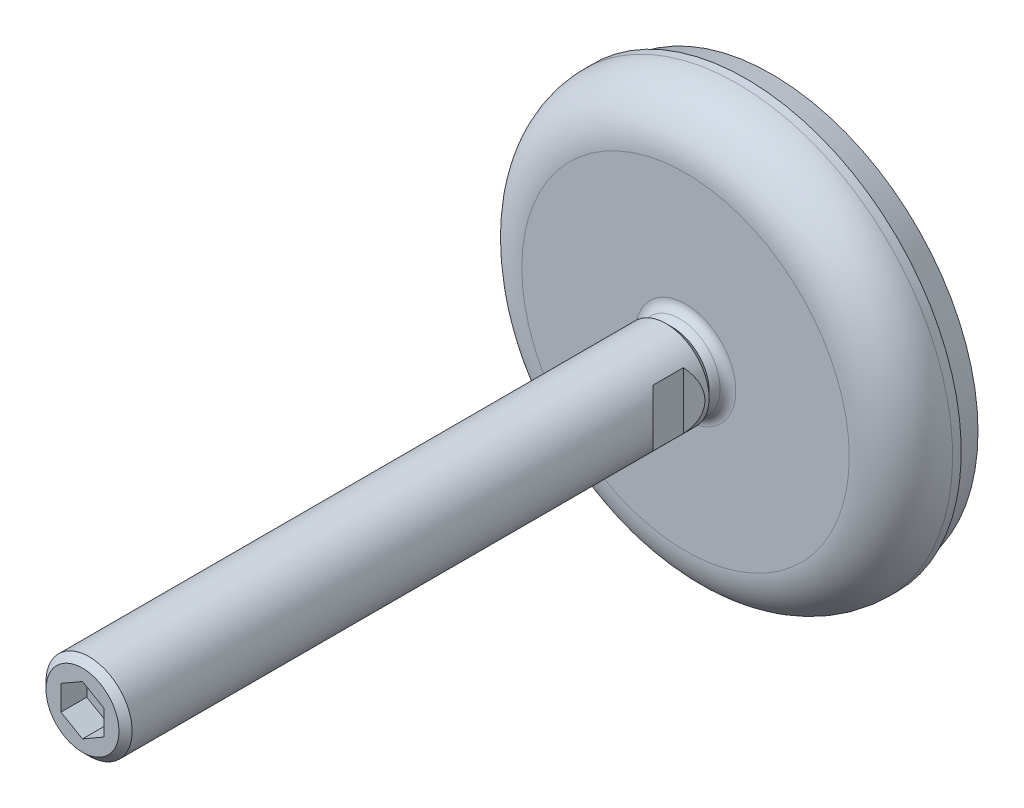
ISO-10303-21;
HEADER;
FILE_DESCRIPTION(('STEP AP214'),'2;1');
FILE_NAME('part.step','',(''),(''),'','','');
FILE_SCHEMA(('AUTOMOTIVE_DESIGN { 1 0 10303 214 1 1 1 1 }'));
ENDSEC;
DATA;
#1=APPLICATION_CONTEXT('core data for automotive mechanical design processes');
#2=APPLICATION_PROTOCOL_DEFINITION('international standard','automotive_design',2000,#1);
#3=PRODUCT_CONTEXT('',#1,'mechanical');
#4=PRODUCT('Part','Part','',(#3));
#5=PRODUCT_RELATED_PRODUCT_CATEGORY('part','',(#4));
#6=PRODUCT_DEFINITION_FORMATION('','',#4);
#7=PRODUCT_DEFINITION_CONTEXT('part definition',#1,'design');
#8=PRODUCT_DEFINITION('design','',#6,#7);
#9=PRODUCT_DEFINITION_SHAPE('','',#8);
#10=(LENGTH_UNIT() NAMED_UNIT(*) SI_UNIT(.MILLI.,.METRE.));
#11=(NAMED_UNIT(*) PLANE_ANGLE_UNIT() SI_UNIT($,.RADIAN.));
#12=(NAMED_UNIT(*) SI_UNIT($,.STERADIAN.) SOLID_ANGLE_UNIT());
#13=UNCERTAINTY_MEASURE_WITH_UNIT(LENGTH_MEASURE(1.E-05),#10,'distance_accuracy_value','');
#14=(GEOMETRIC_REPRESENTATION_CONTEXT(3) GLOBAL_UNCERTAINTY_ASSIGNED_CONTEXT((#13)) GLOBAL_UNIT_ASSIGNED_CONTEXT((#10,
#11,#12)) REPRESENTATION_CONTEXT('',''));
#15=CARTESIAN_POINT('',(0.,0.,0.));
#16=DIRECTION('',(0.,0.,1.));
#17=DIRECTION('',(1.,0.,0.));
#18=AXIS2_PLACEMENT_3D('',#15,#16,#17);
#19=CARTESIAN_POINT('',(0.,0.,24.5335));
#20=DIRECTION('',(0.,0.,-1.));
#21=DIRECTION('',(-1.,0.,0.));
#22=AXIS2_PLACEMENT_3D('',#19,#20,#21);
#23=CYLINDRICAL_SURFACE('',#22,10.);
#24=DIRECTION('',(0.,0.,-1.));
#25=VECTOR('',#24,1.);
#26=CARTESIAN_POINT('',(7.5,6.61437827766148,24.5335));
#27=LINE('',#26,#25);
#28=CARTESIAN_POINT('',(7.5,6.61437827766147,28.));
#29=VERTEX_POINT('',#28);
#30=CARTESIAN_POINT('',(7.5,6.61437827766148,35.));
#31=VERTEX_POINT('',#30);
#32=EDGE_CURVE('E9',#29,#31,#27,.F.);
#33=ORIENTED_EDGE('',*,*,#32,.F.);
#34=CARTESIAN_POINT('',(0.,0.,35.5));
#35=DIRECTION('',(-0.707106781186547,0.,-0.707106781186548));
#36=DIRECTION('',(0.707106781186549,0.,-0.707106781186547));
#37=AXIS2_PLACEMENT_3D('',#34,#35,#36);
#38=ELLIPSE('',#37,14.1421356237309,10.);
#39=CARTESIAN_POINT('',(7.5,-6.61437827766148,28.));
#40=VERTEX_POINT('',#39);
#41=EDGE_CURVE('E215',#40,#29,#38,.F.);
#42=ORIENTED_EDGE('',*,*,#41,.F.);
#43=DIRECTION('',(0.,0.,-1.));
#44=VECTOR('',#43,1.);
#45=CARTESIAN_POINT('',(7.5,-6.61437827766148,24.5335));
#46=LINE('',#45,#44);
#47=CARTESIAN_POINT('',(7.5,-6.61437827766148,35.));
#48=VERTEX_POINT('',#47);
#49=EDGE_CURVE('E217',#48,#40,#46,.T.);
#50=ORIENTED_EDGE('',*,*,#49,.F.);
#51=CARTESIAN_POINT('',(0.,0.,27.5));
#52=DIRECTION('',(-0.70710678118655,0.,0.707106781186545));
#53=DIRECTION('',(-0.707106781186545,0.,-0.70710678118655));
#54=AXIS2_PLACEMENT_3D('',#51,#52,#53);
#55=ELLIPSE('',#54,14.142135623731,10.);
#56=EDGE_CURVE('E22',#31,#48,#55,.F.);
#57=ORIENTED_EDGE('',*,*,#56,.F.);
#58=EDGE_LOOP('',(#33,#42,#50,#57));
#59=FACE_BOUND('',#58,.T.);
#60=DIRECTION('',(0.,0.,-1.));
#61=VECTOR('',#60,1.);
#62=CARTESIAN_POINT('',(-7.5,-6.61437827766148,24.5335));
#63=LINE('',#62,#61);
#64=CARTESIAN_POINT('',(-7.5,-6.61437827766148,28.));
#65=VERTEX_POINT('',#64);
#66=CARTESIAN_POINT('',(-7.5,-6.61437827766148,35.));
#67=VERTEX_POINT('',#66);
#68=EDGE_CURVE('E209',#65,#67,#63,.F.);
#69=ORIENTED_EDGE('',*,*,#68,.F.);
#70=CARTESIAN_POINT('',(0.,0.,35.5));
#71=DIRECTION('',(0.707106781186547,0.,-0.707106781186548));
#72=DIRECTION('',(-0.707106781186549,0.,-0.707106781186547));
#73=AXIS2_PLACEMENT_3D('',#70,#71,#72);
#74=ELLIPSE('',#73,14.1421356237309,10.);
#75=CARTESIAN_POINT('',(-7.5,6.61437827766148,28.));
#76=VERTEX_POINT('',#75);
#77=EDGE_CURVE('E212',#76,#65,#74,.F.);
#78=ORIENTED_EDGE('',*,*,#77,.F.);
#79=DIRECTION('',(0.,0.,-1.));
#80=VECTOR('',#79,1.);
#81=CARTESIAN_POINT('',(-7.5,6.61437827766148,24.5335));
#82=LINE('',#81,#80);
#83=CARTESIAN_POINT('',(-7.5,6.61437827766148,35.));
#84=VERTEX_POINT('',#83);
#85=EDGE_CURVE('E186',#84,#76,#82,.T.);
#86=ORIENTED_EDGE('',*,*,#85,.F.);
#87=CARTESIAN_POINT('',(0.,0.,27.5));
#88=DIRECTION('',(0.70710678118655,0.,0.707106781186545));
#89=DIRECTION('',(0.707106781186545,0.,-0.70710678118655));
#90=AXIS2_PLACEMENT_3D('',#87,#88,#89);
#91=ELLIPSE('',#90,14.142135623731,10.);
#92=EDGE_CURVE('E183',#67,#84,#91,.F.);
#93=ORIENTED_EDGE('',*,*,#92,.F.);
#94=EDGE_LOOP('',(#69,#78,#86,#93));
#95=FACE_BOUND('',#94,.T.);
#96=CARTESIAN_POINT('',(0.,0.,158.4665));
#97=DIRECTION('',(0.,0.,-1.));
#98=DIRECTION('',(0.,1.,0.));
#99=AXIS2_PLACEMENT_3D('',#96,#97,#98);
#100=CIRCLE('',#99,10.);
#101=CARTESIAN_POINT('',(0.,10.,158.4665));
#102=VERTEX_POINT('',#101);
#103=EDGE_CURVE('E191',#102,#102,#100,.T.);
#104=ORIENTED_EDGE('',*,*,#103,.T.);
#105=EDGE_LOOP('',(#104));
#106=FACE_BOUND('',#105,.T.);
#107=CARTESIAN_POINT('',(0.,0.,24.5335));
#108=DIRECTION('',(0.,0.,-1.));
#109=DIRECTION('',(0.,1.,0.));
#110=AXIS2_PLACEMENT_3D('',#107,#108,#109);
#111=CIRCLE('',#110,10.);
#112=CARTESIAN_POINT('',(0.,10.,24.5335));
#113=VERTEX_POINT('',#112);
#114=EDGE_CURVE('E495',#113,#113,#111,.T.);
#115=ORIENTED_EDGE('',*,*,#114,.F.);
#116=EDGE_LOOP('',(#115));
#117=FACE_BOUND('',#116,.T.);
#118=ADVANCED_FACE('F14',(#59,#95,#106,#117),#23,.T.);
#119=CARTESIAN_POINT('',(0.,0.,23.));
#120=DIRECTION('',(0.,0.,1.));
#121=DIRECTION('',(1.,0.,0.));
#122=AXIS2_PLACEMENT_3D('',#119,#120,#121);
#123=CONICAL_SURFACE('',#122,8.4665,0.785398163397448);
#124=ORIENTED_EDGE('',*,*,#114,.T.);
#125=EDGE_LOOP('',(#124));
#126=FACE_BOUND('',#125,.T.);
#127=CARTESIAN_POINT('',(0.,0.,23.));
#128=DIRECTION('',(0.,0.,-1.));
#129=DIRECTION('',(-1.,0.,0.));
#130=AXIS2_PLACEMENT_3D('',#127,#128,#129);
#131=CIRCLE('',#130,8.4665);
#132=CARTESIAN_POINT('',(-8.4665,0.,23.));
#133=VERTEX_POINT('',#132);
#134=EDGE_CURVE('E493',#133,#133,#131,.T.);
#135=ORIENTED_EDGE('',*,*,#134,.F.);
#136=EDGE_LOOP('',(#135));
#137=FACE_BOUND('',#136,.T.);
#138=ADVANCED_FACE('F388',(#126,#137),#123,.T.);
#139=CARTESIAN_POINT('',(0.44576982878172,0.,16.5524076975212));
#140=DIRECTION('',(0.,1.,0.));
#141=DIRECTION('',(-0.0405245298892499,0.,-0.999178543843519));
#142=AXIS2_PLACEMENT_3D('',#139,#140,#141);
#143=CIRCLE('',#142,11.);
#144=TRIMMED_CURVE('',#143,(PARAMETER_VALUE(0.)),(PARAMETER_VALUE(3.06052139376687)),.T.,.PARAMETER.);
#145=CARTESIAN_POINT('',(0.,0.,16.5524076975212));
#146=DIRECTION('',(0.,0.,-1.));
#147=AXIS1_PLACEMENT('',#145,#146);
#148=SURFACE_OF_REVOLUTION('',#144,#147);
#149=ORIENTED_EDGE('',*,*,#134,.T.);
#150=EDGE_LOOP('',(#149));
#151=FACE_BOUND('',#150,.T.);
#152=CARTESIAN_POINT('',(0.,0.,21.3985940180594));
#153=DIRECTION('',(0.,0.,-1.));
#154=DIRECTION('',(-1.,0.,0.));
#155=AXIS2_PLACEMENT_3D('',#152,#153,#154);
#156=CIRCLE('',#155,9.42917210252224);
#157=CARTESIAN_POINT('',(-9.42917210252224,0.,21.3985940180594));
#158=VERTEX_POINT('',#157);
#159=EDGE_CURVE('E203',#158,#158,#156,.T.);
#160=ORIENTED_EDGE('',*,*,#159,.F.);
#161=EDGE_LOOP('',(#160));
#162=FACE_BOUND('',#161,.T.);
#163=ADVANCED_FACE('F397',(#151,#162),#148,.F.);
#164=CARTESIAN_POINT('',(0.,0.,22.5));
#165=DIRECTION('',(0.,0.,-1.));
#166=DIRECTION('',(-1.,0.,0.));
#167=AXIS2_PLACEMENT_3D('',#164,#165,#166);
#168=TOROIDAL_SURFACE('',#167,11.6734770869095,2.5);
#169=CARTESIAN_POINT('',(0.,0.,20.));
#170=DIRECTION('',(0.,0.,-1.));
#171=DIRECTION('',(-1.,0.,0.));
#172=AXIS2_PLACEMENT_3D('',#169,#170,#171);
#173=CIRCLE('',#172,11.6734770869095);
#174=CARTESIAN_POINT('',(-11.6734770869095,0.,20.));
#175=VERTEX_POINT('',#174);
#176=EDGE_CURVE('E200',#175,#175,#173,.T.);
#177=ORIENTED_EDGE('',*,*,#176,.F.);
#178=EDGE_LOOP('',(#177));
#179=FACE_BOUND('',#178,.T.);
#180=ORIENTED_EDGE('',*,*,#159,.T.);
#181=EDGE_LOOP('',(#180));
#182=FACE_BOUND('',#181,.T.);
#183=ADVANCED_FACE('F407',(#179,#182),#168,.F.);
#184=CARTESIAN_POINT('',(-38.,38.,20.));
#185=CARTESIAN_POINT('',(-38.,-38.,20.));
#186=CARTESIAN_POINT('',(-38.,-38.76,20.));
#187=B_SPLINE_CURVE_WITH_KNOTS('',1,(#184,#185,#186),.UNSPECIFIED.,.F.,.F.,(2,1,2),(0.,1.,1.01),.UNSPECIFIED.);
#188=DIRECTION('',(1.,0.,0.));
#189=VECTOR('',#188,1.);
#190=SURFACE_OF_LINEAR_EXTRUSION('',#187,#189);
#191=ORIENTED_EDGE('',*,*,#176,.T.);
#192=EDGE_LOOP('',(#191));
#193=FACE_BOUND('',#192,.T.);
#194=CARTESIAN_POINT('',(0.,0.,20.));
#195=DIRECTION('',(0.,0.,-1.));
#196=DIRECTION('',(-1.,0.,0.));
#197=AXIS2_PLACEMENT_3D('',#194,#195,#196);
#198=CIRCLE('',#197,38.);
#199=CARTESIAN_POINT('',(-38.,0.,20.));
#200=VERTEX_POINT('',#199);
#201=EDGE_CURVE('E197',#200,#200,#198,.T.);
#202=ORIENTED_EDGE('',*,*,#201,.F.);
#203=EDGE_LOOP('',(#202));
#204=FACE_BOUND('',#203,.T.);
#205=ADVANCED_FACE('F415',(#193,#204),#190,.T.);
#206=CARTESIAN_POINT('',(0.,0.,8.));
#207=DIRECTION('',(0.,0.,-1.));
#208=DIRECTION('',(-1.,0.,0.));
#209=AXIS2_PLACEMENT_3D('',#206,#207,#208);
#210=TOROIDAL_SURFACE('',#209,38.,12.);
#211=ORIENTED_EDGE('',*,*,#201,.T.);
#212=EDGE_LOOP('',(#211));
#213=FACE_BOUND('',#212,.T.);
#214=CARTESIAN_POINT('',(0.,0.,8.));
#215=DIRECTION('',(0.,0.,-1.));
#216=DIRECTION('',(0.,1.,0.));
#217=AXIS2_PLACEMENT_3D('',#214,#215,#216);
#218=CIRCLE('',#217,50.);
#219=CARTESIAN_POINT('',(0.,50.,8.));
#220=VERTEX_POINT('',#219);
#221=EDGE_CURVE('E196',#220,#220,#218,.T.);
#222=ORIENTED_EDGE('',*,*,#221,.F.);
#223=EDGE_LOOP('',(#222));
#224=FACE_BOUND('',#223,.T.);
#225=ADVANCED_FACE('F420',(#213,#224),#210,.T.);
#226=CARTESIAN_POINT('',(0.,0.,6.));
#227=DIRECTION('',(0.,0.,-1.));
#228=DIRECTION('',(-1.,0.,0.));
#229=AXIS2_PLACEMENT_3D('',#226,#227,#228);
#230=CYLINDRICAL_SURFACE('',#229,50.);
#231=CARTESIAN_POINT('',(0.,0.,6.));
#232=DIRECTION('',(0.,0.,-1.));
#233=DIRECTION('',(-1.,0.,0.));
#234=AXIS2_PLACEMENT_3D('',#231,#232,#233);
#235=CIRCLE('',#234,50.);
#236=CARTESIAN_POINT('',(-50.,0.,6.));
#237=VERTEX_POINT('',#236);
#238=EDGE_CURVE('E188',#237,#237,#235,.T.);
#239=ORIENTED_EDGE('',*,*,#238,.F.);
#240=EDGE_LOOP('',(#239));
#241=FACE_BOUND('',#240,.T.);
#242=ORIENTED_EDGE('',*,*,#221,.T.);
#243=EDGE_LOOP('',(#242));
#244=FACE_BOUND('',#243,.T.);
#245=ADVANCED_FACE('F430',(#241,#244),#230,.T.);
#246=CARTESIAN_POINT('',(-50.6000021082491,-50.,6.));
#247=DIRECTION('',(0.,0.,-1.));
#248=DIRECTION('',(0.,1.,0.));
#249=AXIS2_PLACEMENT_3D('',#246,#247,#248);
#250=PLANE('',#249);
#251=CARTESIAN_POINT('',(0.,0.,6.));
#252=DIRECTION('',(0.,0.,1.));
#253=DIRECTION('',(1.,0.,0.));
#254=AXIS2_PLACEMENT_3D('',#251,#252,#253);
#255=CIRCLE('',#254,49.5);
#256=CARTESIAN_POINT('',(49.5,0.,6.));
#257=VERTEX_POINT('',#256);
#258=EDGE_CURVE('E179',#257,#257,#255,.F.);
#259=ORIENTED_EDGE('',*,*,#258,.F.);
#260=EDGE_LOOP('',(#259));
#261=FACE_BOUND('',#260,.T.);
#262=ORIENTED_EDGE('',*,*,#238,.T.);
#263=EDGE_LOOP('',(#262));
#264=FACE_BOUND('',#263,.T.);
#265=ADVANCED_FACE('F174',(#261,#264),#250,.T.);
#266=CARTESIAN_POINT('',(-48.4670146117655,-47.8923048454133,0.));
#267=DIRECTION('',(0.,0.,-1.));
#268=DIRECTION('',(0.,1.,0.));
#269=AXIS2_PLACEMENT_3D('',#266,#267,#268);
#270=PLANE('',#269);
#271=CARTESIAN_POINT('',(0.,0.,0.));
#272=DIRECTION('',(0.,0.,1.));
#273=DIRECTION('',(1.,0.,0.));
#274=AXIS2_PLACEMENT_3D('',#271,#272,#273);
#275=CIRCLE('',#274,47.8923048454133);
#276=CARTESIAN_POINT('',(47.8923048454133,0.,0.));
#277=VERTEX_POINT('',#276);
#278=EDGE_CURVE('E182',#277,#277,#275,.T.);
#279=ORIENTED_EDGE('',*,*,#278,.F.);
#280=EDGE_LOOP('',(#279));
#281=FACE_BOUND('',#280,.T.);
#282=ADVANCED_FACE('F165',(#281),#270,.T.);
#283=CARTESIAN_POINT('',(0.,0.,0.));
#284=DIRECTION('',(0.,0.,1.));
#285=DIRECTION('',(1.,0.,0.));
#286=AXIS2_PLACEMENT_3D('',#283,#284,#285);
#287=CONICAL_SURFACE('',#286,47.8923048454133,0.261799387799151);
#288=ORIENTED_EDGE('',*,*,#258,.T.);
#289=EDGE_LOOP('',(#288));
#290=FACE_BOUND('',#289,.T.);
#291=ORIENTED_EDGE('',*,*,#278,.T.);
#292=EDGE_LOOP('',(#291));
#293=FACE_BOUND('',#292,.T.);
#294=ADVANCED_FACE('F16',(#290,#293),#287,.T.);
#295=CARTESIAN_POINT('',(-5.,-5.84278472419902,154.));
#296=DIRECTION('',(0.,0.,1.));
#297=DIRECTION('',(1.,0.,0.));
#298=AXIS2_PLACEMENT_3D('',#295,#296,#297);
#299=PLANE('',#298);
#300=DIRECTION('',(0.866025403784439,0.5,0.));
#301=VECTOR('',#300,1.);
#302=CARTESIAN_POINT('',(-2.5,4.3301270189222,154.));
#303=LINE('',#302,#301);
#304=CARTESIAN_POINT('',(-5.,2.88675134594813,154.));
#305=VERTEX_POINT('',#304);
#306=CARTESIAN_POINT('',(1.08254979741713E-07,5.77350262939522,154.));
#307=VERTEX_POINT('',#306);
#308=EDGE_CURVE('E138',#305,#307,#303,.T.);
#309=ORIENTED_EDGE('',*,*,#308,.F.);
#310=DIRECTION('',(0.,1.,0.));
#311=VECTOR('',#310,1.);
#312=CARTESIAN_POINT('',(-5.,0.,154.));
#313=LINE('',#312,#311);
#314=CARTESIAN_POINT('',(-5.,-2.88675134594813,154.));
#315=VERTEX_POINT('',#314);
#316=EDGE_CURVE('E72',#315,#305,#313,.T.);
#317=ORIENTED_EDGE('',*,*,#316,.F.);
#318=DIRECTION('',(-0.866025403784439,0.5,0.));
#319=VECTOR('',#318,1.);
#320=CARTESIAN_POINT('',(-2.5,-4.3301270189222,154.));
#321=LINE('',#320,#319);
#322=CARTESIAN_POINT('',(-2.16509959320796E-07,-5.77350256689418,154.));
#323=VERTEX_POINT('',#322);
#324=EDGE_CURVE('E68',#323,#315,#321,.T.);
#325=ORIENTED_EDGE('',*,*,#324,.F.);
#326=DIRECTION('',(-0.866025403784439,-0.5,0.));
#327=VECTOR('',#326,1.);
#328=CARTESIAN_POINT('',(2.5,-4.3301270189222,154.));
#329=LINE('',#328,#327);
#330=CARTESIAN_POINT('',(5.,-2.88675134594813,154.));
#331=VERTEX_POINT('',#330);
#332=EDGE_CURVE('E91',#331,#323,#329,.T.);
#333=ORIENTED_EDGE('',*,*,#332,.F.);
#334=DIRECTION('',(0.,-1.,0.));
#335=VECTOR('',#334,1.);
#336=CARTESIAN_POINT('',(5.,0.,154.));
#337=LINE('',#336,#335);
#338=CARTESIAN_POINT('',(5.,2.88675134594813,154.));
#339=VERTEX_POINT('',#338);
#340=EDGE_CURVE('E149',#339,#331,#337,.T.);
#341=ORIENTED_EDGE('',*,*,#340,.F.);
#342=DIRECTION('',(0.866025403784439,-0.5,0.));
#343=VECTOR('',#342,1.);
#344=CARTESIAN_POINT('',(2.5,4.3301270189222,154.));
#345=LINE('',#344,#343);
#346=EDGE_CURVE('E142',#307,#339,#345,.T.);
#347=ORIENTED_EDGE('',*,*,#346,.F.);
#348=EDGE_LOOP('',(#309,#317,#325,#333,#341,#347));
#349=FACE_BOUND('',#348,.T.);
#350=ADVANCED_FACE('F164',(#349),#299,.T.);
#351=CARTESIAN_POINT('',(5.,2.88675134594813,160.));
#352=DIRECTION('',(-0.5,-0.866025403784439,0.));
#353=DIRECTION('',(-0.866025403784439,0.5,0.));
#354=AXIS2_PLACEMENT_3D('',#351,#352,#353);
#355=PLANE('',#354);
#356=ORIENTED_EDGE('',*,*,#346,.T.);
#357=DIRECTION('',(0.,0.,-1.));
#358=VECTOR('',#357,1.);
#359=CARTESIAN_POINT('',(5.,2.88675134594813,160.));
#360=LINE('',#359,#358);
#361=CARTESIAN_POINT('',(5.,2.88675134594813,160.));
#362=VERTEX_POINT('',#361);
#363=EDGE_CURVE('E146',#362,#339,#360,.T.);
#364=ORIENTED_EDGE('',*,*,#363,.F.);
#365=CARTESIAN_POINT('',(0.,5.77350269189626,160.));
#366=CARTESIAN_POINT('',(0.208333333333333,5.65322138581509,160.));
#367=CARTESIAN_POINT('',(0.416666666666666,5.53294007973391,160.));
#368=CARTESIAN_POINT('',(0.833333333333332,5.29237746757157,160.));
#369=CARTESIAN_POINT('',(1.04166666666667,5.1720961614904,160.));
#370=CARTESIAN_POINT('',(1.45833333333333,4.93153354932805,160.));
#371=CARTESIAN_POINT('',(1.66666666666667,4.81125224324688,160.));
#372=CARTESIAN_POINT('',(2.08333333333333,4.57068963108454,160.));
#373=CARTESIAN_POINT('',(2.29166666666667,4.45040832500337,160.));
#374=CARTESIAN_POINT('',(2.70833333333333,4.20984571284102,160.));
#375=CARTESIAN_POINT('',(2.91666666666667,4.08956440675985,160.));
#376=CARTESIAN_POINT('',(3.33333333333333,3.84900179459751,160.));
#377=CARTESIAN_POINT('',(3.54166666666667,3.72872048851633,160.));
#378=CARTESIAN_POINT('',(3.95833333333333,3.48815787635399,160.));
#379=CARTESIAN_POINT('',(4.16666666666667,3.36787657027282,160.));
#380=CARTESIAN_POINT('',(4.58333333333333,3.12731395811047,160.));
#381=CARTESIAN_POINT('',(4.79166666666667,3.0070326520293,160.));
#382=CARTESIAN_POINT('',(5.,2.88675134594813,160.));
#383=B_SPLINE_CURVE_WITH_KNOTS('',3,(#365,#366,#367,#368,#369,#370,#371,#372,#373,#374,#375,
#376,#377,#378,#379,#380,#381,#382),.UNSPECIFIED.,.F.,.F.,(4,2,2,2,2,2,2,2,4),(0.,
0.721687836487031,1.44337567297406,2.1650635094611,2.88675134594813,3.60843918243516,
4.33012701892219,5.05181485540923,5.77350269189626),.UNSPECIFIED.);
#384=CARTESIAN_POINT('',(-6.25268751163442E-08,5.77350265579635,160.));
#385=VERTEX_POINT('',#384);
#386=EDGE_CURVE('E120',#385,#362,#383,.T.);
#387=ORIENTED_EDGE('',*,*,#386,.F.);
#388=DIRECTION('',(0.,0.,-1.));
#389=VECTOR('',#388,1.);
#390=CARTESIAN_POINT('',(0.,5.77350269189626,160.));
#391=LINE('',#390,#389);
#392=EDGE_CURVE('E135',#385,#307,#391,.T.);
#393=ORIENTED_EDGE('',*,*,#392,.T.);
#394=EDGE_LOOP('',(#356,#364,#387,#393));
#395=FACE_BOUND('',#394,.T.);
#396=ADVANCED_FACE('F144',(#395),#355,.T.);
#397=CARTESIAN_POINT('',(0.,5.77350269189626,160.));
#398=DIRECTION('',(0.5,-0.866025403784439,0.));
#399=DIRECTION('',(-0.866025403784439,-0.5,0.));
#400=AXIS2_PLACEMENT_3D('',#397,#398,#399);
#401=PLANE('',#400);
#402=ORIENTED_EDGE('',*,*,#308,.T.);
#403=ORIENTED_EDGE('',*,*,#392,.F.);
#404=CARTESIAN_POINT('',(-5.,2.88675134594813,160.));
#405=CARTESIAN_POINT('',(-4.79166666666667,3.0070326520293,160.));
#406=CARTESIAN_POINT('',(-4.58333333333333,3.12731395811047,160.));
#407=CARTESIAN_POINT('',(-4.16666666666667,3.36787657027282,160.));
#408=CARTESIAN_POINT('',(-3.95833333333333,3.48815787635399,160.));
#409=CARTESIAN_POINT('',(-3.54166666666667,3.72872048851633,160.));
#410=CARTESIAN_POINT('',(-3.33333333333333,3.84900179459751,160.));
#411=CARTESIAN_POINT('',(-2.91666666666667,4.08956440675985,160.));
#412=CARTESIAN_POINT('',(-2.70833333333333,4.20984571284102,160.));
#413=CARTESIAN_POINT('',(-2.29166666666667,4.45040832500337,160.));
#414=CARTESIAN_POINT('',(-2.08333333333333,4.57068963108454,160.));
#415=CARTESIAN_POINT('',(-1.66666666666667,4.81125224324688,160.));
#416=CARTESIAN_POINT('',(-1.45833333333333,4.93153354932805,160.));
#417=CARTESIAN_POINT('',(-1.04166666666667,5.1720961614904,160.));
#418=CARTESIAN_POINT('',(-0.833333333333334,5.29237746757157,160.));
#419=CARTESIAN_POINT('',(-0.416666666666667,5.53294007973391,160.));
#420=CARTESIAN_POINT('',(-0.208333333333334,5.65322138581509,160.));
#421=CARTESIAN_POINT('',(0.,5.77350269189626,160.));
#422=B_SPLINE_CURVE_WITH_KNOTS('',3,(#404,#405,#406,#407,#408,#409,#410,#411,#412,#413,#414,
#415,#416,#417,#418,#419,#420,#421),.UNSPECIFIED.,.F.,.F.,(4,2,2,2,2,2,2,2,4),(0.,
0.721687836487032,1.44337567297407,2.1650635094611,2.88675134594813,3.60843918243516,
4.33012701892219,5.05181485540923,5.77350269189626),.UNSPECIFIED.);
#423=CARTESIAN_POINT('',(-5.,2.88675134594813,160.));
#424=VERTEX_POINT('',#423);
#425=EDGE_CURVE('E82',#424,#385,#422,.T.);
#426=ORIENTED_EDGE('',*,*,#425,.F.);
#427=DIRECTION('',(0.,0.,-1.));
#428=VECTOR('',#427,1.);
#429=CARTESIAN_POINT('',(-5.,2.88675134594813,160.));
#430=LINE('',#429,#428);
#431=EDGE_CURVE('E78',#424,#305,#430,.T.);
#432=ORIENTED_EDGE('',*,*,#431,.T.);
#433=EDGE_LOOP('',(#402,#403,#426,#432));
#434=FACE_BOUND('',#433,.T.);
#435=ADVANCED_FACE('F132',(#434),#401,.T.);
#436=CARTESIAN_POINT('',(-5.,2.88675134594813,160.));
#437=DIRECTION('',(1.,0.,0.));
#438=DIRECTION('',(0.,-1.,0.));
#439=AXIS2_PLACEMENT_3D('',#436,#437,#438);
#440=PLANE('',#439);
#441=ORIENTED_EDGE('',*,*,#316,.T.);
#442=ORIENTED_EDGE('',*,*,#431,.F.);
#443=DIRECTION('',(0.,1.,0.));
#444=VECTOR('',#443,1.);
#445=CARTESIAN_POINT('',(-5.,0.,160.));
#446=LINE('',#445,#444);
#447=CARTESIAN_POINT('',(-5.,-2.88675134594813,160.));
#448=VERTEX_POINT('',#447);
#449=EDGE_CURVE('E75',#448,#424,#446,.T.);
#450=ORIENTED_EDGE('',*,*,#449,.F.);
#451=DIRECTION('',(0.,0.,-1.));
#452=VECTOR('',#451,1.);
#453=CARTESIAN_POINT('',(-5.,-2.88675134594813,160.));
#454=LINE('',#453,#452);
#455=EDGE_CURVE('E59',#448,#315,#454,.T.);
#456=ORIENTED_EDGE('',*,*,#455,.T.);
#457=EDGE_LOOP('',(#441,#442,#450,#456));
#458=FACE_BOUND('',#457,.T.);
#459=ADVANCED_FACE('F76',(#458),#440,.T.);
#460=CARTESIAN_POINT('',(-5.,-2.88675134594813,160.));
#461=DIRECTION('',(0.5,0.866025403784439,0.));
#462=DIRECTION('',(0.866025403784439,-0.5,0.));
#463=AXIS2_PLACEMENT_3D('',#460,#461,#462);
#464=PLANE('',#463);
#465=ORIENTED_EDGE('',*,*,#324,.T.);
#466=ORIENTED_EDGE('',*,*,#455,.F.);
#467=CARTESIAN_POINT('',(0.,-5.77350269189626,160.));
#468=CARTESIAN_POINT('',(-0.208333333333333,-5.65322138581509,160.));
#469=CARTESIAN_POINT('',(-0.416666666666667,-5.53294007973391,160.));
#470=CARTESIAN_POINT('',(-0.833333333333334,-5.29237746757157,160.));
#471=CARTESIAN_POINT('',(-1.04166666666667,-5.1720961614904,160.));
#472=CARTESIAN_POINT('',(-1.45833333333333,-4.93153354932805,160.));
#473=CARTESIAN_POINT('',(-1.66666666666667,-4.81125224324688,160.));
#474=CARTESIAN_POINT('',(-2.08333333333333,-4.57068963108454,160.));
#475=CARTESIAN_POINT('',(-2.29166666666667,-4.45040832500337,160.));
#476=CARTESIAN_POINT('',(-2.70833333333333,-4.20984571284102,160.));
#477=CARTESIAN_POINT('',(-2.91666666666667,-4.08956440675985,160.));
#478=CARTESIAN_POINT('',(-3.33333333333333,-3.84900179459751,160.));
#479=CARTESIAN_POINT('',(-3.54166666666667,-3.72872048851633,160.));
#480=CARTESIAN_POINT('',(-3.95833333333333,-3.48815787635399,160.));
#481=CARTESIAN_POINT('',(-4.16666666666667,-3.36787657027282,160.));
#482=CARTESIAN_POINT('',(-4.58333333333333,-3.12731395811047,160.));
#483=CARTESIAN_POINT('',(-4.79166666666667,-3.0070326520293,160.));
#484=CARTESIAN_POINT('',(-5.,-2.88675134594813,160.));
#485=B_SPLINE_CURVE_WITH_KNOTS('',3,(#467,#468,#469,#470,#471,#472,#473,#474,#475,#476,#477,
#478,#479,#480,#481,#482,#483,#484),.UNSPECIFIED.,.F.,.F.,(4,2,2,2,2,2,2,2,4),(0.,
0.721687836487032,1.44337567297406,2.1650635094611,2.88675134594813,3.60843918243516,
4.33012701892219,5.05181485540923,5.77350269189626),.UNSPECIFIED.);
#486=CARTESIAN_POINT('',(-6.25268746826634E-08,-5.77350265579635,160.));
#487=VERTEX_POINT('',#486);
#488=EDGE_CURVE('E64',#487,#448,#485,.T.);
#489=ORIENTED_EDGE('',*,*,#488,.F.);
#490=DIRECTION('',(0.,0.,-1.));
#491=VECTOR('',#490,1.);
#492=CARTESIAN_POINT('',(0.,-5.77350269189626,160.));
#493=LINE('',#492,#491);
#494=EDGE_CURVE('E89',#323,#487,#493,.F.);
#495=ORIENTED_EDGE('',*,*,#494,.F.);
#496=EDGE_LOOP('',(#465,#466,#489,#495));
#497=FACE_BOUND('',#496,.T.);
#498=ADVANCED_FACE('F61',(#497),#464,.T.);
#499=CARTESIAN_POINT('',(0.,-5.77350269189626,160.));
#500=DIRECTION('',(-0.5,0.866025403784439,0.));
#501=DIRECTION('',(0.866025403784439,0.5,0.));
#502=AXIS2_PLACEMENT_3D('',#499,#500,#501);
#503=PLANE('',#502);
#504=ORIENTED_EDGE('',*,*,#332,.T.);
#505=ORIENTED_EDGE('',*,*,#494,.T.);
#506=CARTESIAN_POINT('',(5.,-2.88675134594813,160.));
#507=CARTESIAN_POINT('',(4.79166666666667,-3.0070326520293,160.));
#508=CARTESIAN_POINT('',(4.58333333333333,-3.12731395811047,160.));
#509=CARTESIAN_POINT('',(4.16666666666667,-3.36787657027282,160.));
#510=CARTESIAN_POINT('',(3.95833333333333,-3.48815787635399,160.));
#511=CARTESIAN_POINT('',(3.54166666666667,-3.72872048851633,160.));
#512=CARTESIAN_POINT('',(3.33333333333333,-3.84900179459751,160.));
#513=CARTESIAN_POINT('',(2.91666666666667,-4.08956440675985,160.));
#514=CARTESIAN_POINT('',(2.70833333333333,-4.20984571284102,160.));
#515=CARTESIAN_POINT('',(2.29166666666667,-4.45040832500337,160.));
#516=CARTESIAN_POINT('',(2.08333333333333,-4.57068963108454,160.));
#517=CARTESIAN_POINT('',(1.66666666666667,-4.81125224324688,160.));
#518=CARTESIAN_POINT('',(1.45833333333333,-4.93153354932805,160.));
#519=CARTESIAN_POINT('',(1.04166666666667,-5.1720961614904,160.));
#520=CARTESIAN_POINT('',(0.833333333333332,-5.29237746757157,160.));
#521=CARTESIAN_POINT('',(0.416666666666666,-5.53294007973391,160.));
#522=CARTESIAN_POINT('',(0.208333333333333,-5.65322138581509,160.));
#523=CARTESIAN_POINT('',(0.,-5.77350269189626,160.));
#524=B_SPLINE_CURVE_WITH_KNOTS('',3,(#506,#507,#508,#509,#510,#511,#512,#513,#514,#515,#516,
#517,#518,#519,#520,#521,#522,#523),.UNSPECIFIED.,.F.,.F.,(4,2,2,2,2,2,2,2,4),(0.,
0.721687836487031,1.44337567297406,2.1650635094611,2.88675134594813,3.60843918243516,
4.33012701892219,5.05181485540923,5.77350269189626),.UNSPECIFIED.);
#525=CARTESIAN_POINT('',(5.,-2.88675134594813,160.));
#526=VERTEX_POINT('',#525);
#527=EDGE_CURVE('E88',#526,#487,#524,.T.);
#528=ORIENTED_EDGE('',*,*,#527,.F.);
#529=DIRECTION('',(0.,0.,-1.));
#530=VECTOR('',#529,1.);
#531=CARTESIAN_POINT('',(5.,-2.88675134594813,160.));
#532=LINE('',#531,#530);
#533=EDGE_CURVE('E37',#526,#331,#532,.T.);
#534=ORIENTED_EDGE('',*,*,#533,.T.);
#535=EDGE_LOOP('',(#504,#505,#528,#534));
#536=FACE_BOUND('',#535,.T.);
#537=ADVANCED_FACE('F111',(#536),#503,.T.);
#538=CARTESIAN_POINT('',(5.,-2.88675134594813,160.));
#539=DIRECTION('',(-1.,0.,0.));
#540=DIRECTION('',(0.,1.,0.));
#541=AXIS2_PLACEMENT_3D('',#538,#539,#540);
#542=PLANE('',#541);
#543=ORIENTED_EDGE('',*,*,#340,.T.);
#544=ORIENTED_EDGE('',*,*,#533,.F.);
#545=DIRECTION('',(0.,-1.,0.));
#546=VECTOR('',#545,1.);
#547=CARTESIAN_POINT('',(5.,0.,160.));
#548=LINE('',#547,#546);
#549=EDGE_CURVE('E123',#362,#526,#548,.T.);
#550=ORIENTED_EDGE('',*,*,#549,.F.);
#551=ORIENTED_EDGE('',*,*,#363,.T.);
#552=EDGE_LOOP('',(#543,#544,#550,#551));
#553=FACE_BOUND('',#552,.T.);
#554=ADVANCED_FACE('F151',(#553),#542,.T.);
#555=CARTESIAN_POINT('',(-8.56810010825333,8.4665,160.));
#556=DIRECTION('',(0.,0.,1.));
#557=DIRECTION('',(0.,-1.,0.));
#558=AXIS2_PLACEMENT_3D('',#555,#556,#557);
#559=PLANE('',#558);
#560=ORIENTED_EDGE('',*,*,#549,.T.);
#561=ORIENTED_EDGE('',*,*,#527,.T.);
#562=ORIENTED_EDGE('',*,*,#488,.T.);
#563=ORIENTED_EDGE('',*,*,#449,.T.);
#564=ORIENTED_EDGE('',*,*,#425,.T.);
#565=ORIENTED_EDGE('',*,*,#386,.T.);
#566=EDGE_LOOP('',(#560,#561,#562,#563,#564,#565));
#567=FACE_BOUND('',#566,.T.);
#568=CARTESIAN_POINT('',(0.,0.,160.));
#569=DIRECTION('',(0.,0.,-1.));
#570=DIRECTION('',(-1.,0.,0.));
#571=AXIS2_PLACEMENT_3D('',#568,#569,#570);
#572=CIRCLE('',#571,8.4665);
#573=CARTESIAN_POINT('',(-8.4665,0.,160.));
#574=VERTEX_POINT('',#573);
#575=EDGE_CURVE('E204',#574,#574,#572,.T.);
#576=ORIENTED_EDGE('',*,*,#575,.F.);
#577=EDGE_LOOP('',(#576));
#578=FACE_BOUND('',#577,.T.);
#579=ADVANCED_FACE('F86',(#567,#578),#559,.T.);
#580=CARTESIAN_POINT('',(0.,0.,160.));
#581=DIRECTION('',(0.,0.,-1.));
#582=DIRECTION('',(-1.,0.,0.));
#583=AXIS2_PLACEMENT_3D('',#580,#581,#582);
#584=CONICAL_SURFACE('',#583,8.4665,0.78539816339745);
#585=ORIENTED_EDGE('',*,*,#103,.F.);
#586=EDGE_LOOP('',(#585));
#587=FACE_BOUND('',#586,.T.);
#588=ORIENTED_EDGE('',*,*,#575,.T.);
#589=EDGE_LOOP('',(#588));
#590=FACE_BOUND('',#589,.T.);
#591=ADVANCED_FACE('F160',(#587,#590),#584,.T.);
#592=CARTESIAN_POINT('',(-10.,-15.,25.5));
#593=DIRECTION('',(0.707106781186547,0.,-0.707106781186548));
#594=DIRECTION('',(-0.707106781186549,0.,-0.707106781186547));
#595=AXIS2_PLACEMENT_3D('',#592,#593,#594);
#596=PLANE('',#595);
#597=ORIENTED_EDGE('',*,*,#77,.T.);
#598=DIRECTION('',(0.,1.,0.));
#599=VECTOR('',#598,1.);
#600=CARTESIAN_POINT('',(-7.5,-15.,28.));
#601=LINE('',#600,#599);
#602=EDGE_CURVE('E242',#65,#76,#601,.T.);
#603=ORIENTED_EDGE('',*,*,#602,.T.);
#604=EDGE_LOOP('',(#597,#603));
#605=FACE_BOUND('',#604,.T.);
#606=ADVANCED_FACE('F286',(#605),#596,.F.);
#607=CARTESIAN_POINT('',(-7.5,-15.,28.));
#608=DIRECTION('',(1.,0.,0.));
#609=DIRECTION('',(0.,0.,-1.));
#610=AXIS2_PLACEMENT_3D('',#607,#608,#609);
#611=PLANE('',#610);
#612=ORIENTED_EDGE('',*,*,#68,.T.);
#613=DIRECTION('',(0.,1.,0.));
#614=VECTOR('',#613,1.);
#615=CARTESIAN_POINT('',(-7.5,-15.,35.));
#616=LINE('',#615,#614);
#617=EDGE_CURVE('E235',#67,#84,#616,.T.);
#618=ORIENTED_EDGE('',*,*,#617,.T.);
#619=ORIENTED_EDGE('',*,*,#85,.T.);
#620=ORIENTED_EDGE('',*,*,#602,.F.);
#621=EDGE_LOOP('',(#612,#618,#619,#620));
#622=FACE_BOUND('',#621,.T.);
#623=ADVANCED_FACE('F276',(#622),#611,.F.);
#624=CARTESIAN_POINT('',(-7.5,-15.,35.));
#625=DIRECTION('',(0.70710678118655,0.,0.707106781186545));
#626=DIRECTION('',(0.707106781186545,0.,-0.70710678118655));
#627=AXIS2_PLACEMENT_3D('',#624,#625,#626);
#628=PLANE('',#627);
#629=ORIENTED_EDGE('',*,*,#617,.F.);
#630=ORIENTED_EDGE('',*,*,#92,.T.);
#631=EDGE_LOOP('',(#629,#630));
#632=FACE_BOUND('',#631,.T.);
#633=ADVANCED_FACE('F277',(#632),#628,.F.);
#634=CARTESIAN_POINT('',(7.5,-15.,35.));
#635=DIRECTION('',(-0.70710678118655,0.,0.707106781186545));
#636=DIRECTION('',(0.707106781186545,0.,0.70710678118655));
#637=AXIS2_PLACEMENT_3D('',#634,#635,#636);
#638=PLANE('',#637);
#639=DIRECTION('',(0.,1.,0.));
#640=VECTOR('',#639,1.);
#641=CARTESIAN_POINT('',(7.5,-15.,35.));
#642=LINE('',#641,#640);
#643=EDGE_CURVE('E226',#48,#31,#642,.T.);
#644=ORIENTED_EDGE('',*,*,#643,.T.);
#645=ORIENTED_EDGE('',*,*,#56,.T.);
#646=EDGE_LOOP('',(#644,#645));
#647=FACE_BOUND('',#646,.T.);
#648=ADVANCED_FACE('F224',(#647),#638,.F.);
#649=CARTESIAN_POINT('',(7.5,-15.,28.));
#650=DIRECTION('',(-1.,0.,0.));
#651=DIRECTION('',(0.,0.,1.));
#652=AXIS2_PLACEMENT_3D('',#649,#650,#651);
#653=PLANE('',#652);
#654=ORIENTED_EDGE('',*,*,#32,.T.);
#655=ORIENTED_EDGE('',*,*,#643,.F.);
#656=ORIENTED_EDGE('',*,*,#49,.T.);
#657=DIRECTION('',(0.,1.,0.));
#658=VECTOR('',#657,1.);
#659=CARTESIAN_POINT('',(7.5,-15.,28.));
#660=LINE('',#659,#658);
#661=EDGE_CURVE('E28',#40,#29,#660,.T.);
#662=ORIENTED_EDGE('',*,*,#661,.T.);
#663=EDGE_LOOP('',(#654,#655,#656,#662));
#664=FACE_BOUND('',#663,.T.);
#665=ADVANCED_FACE('F233',(#664),#653,.F.);
#666=CARTESIAN_POINT('',(10.,-15.,25.5));
#667=DIRECTION('',(-0.707106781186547,0.,-0.707106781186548));
#668=DIRECTION('',(-0.707106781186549,0.,0.707106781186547));
#669=AXIS2_PLACEMENT_3D('',#666,#667,#668);
#670=PLANE('',#669);
#671=ORIENTED_EDGE('',*,*,#41,.T.);
#672=ORIENTED_EDGE('',*,*,#661,.F.);
#673=EDGE_LOOP('',(#671,#672));
#674=FACE_BOUND('',#673,.T.);
#675=ADVANCED_FACE('F238',(#674),#670,.F.);
#676=CLOSED_SHELL('',(#118,#138,#163,#183,#205,#225,#245,#265,#282,#294,#350,#396,#435,#459,
#498,#537,#554,#579,#591,#606,#623,#633,#648,#665,#675));
#677=MANIFOLD_SOLID_BREP('B1',#676);
#678=ADVANCED_BREP_SHAPE_REPRESENTATION('',(#18,#677),#14);
#679=SHAPE_DEFINITION_REPRESENTATION(#9,#678);
ENDSEC;
END-ISO-10303-21;
